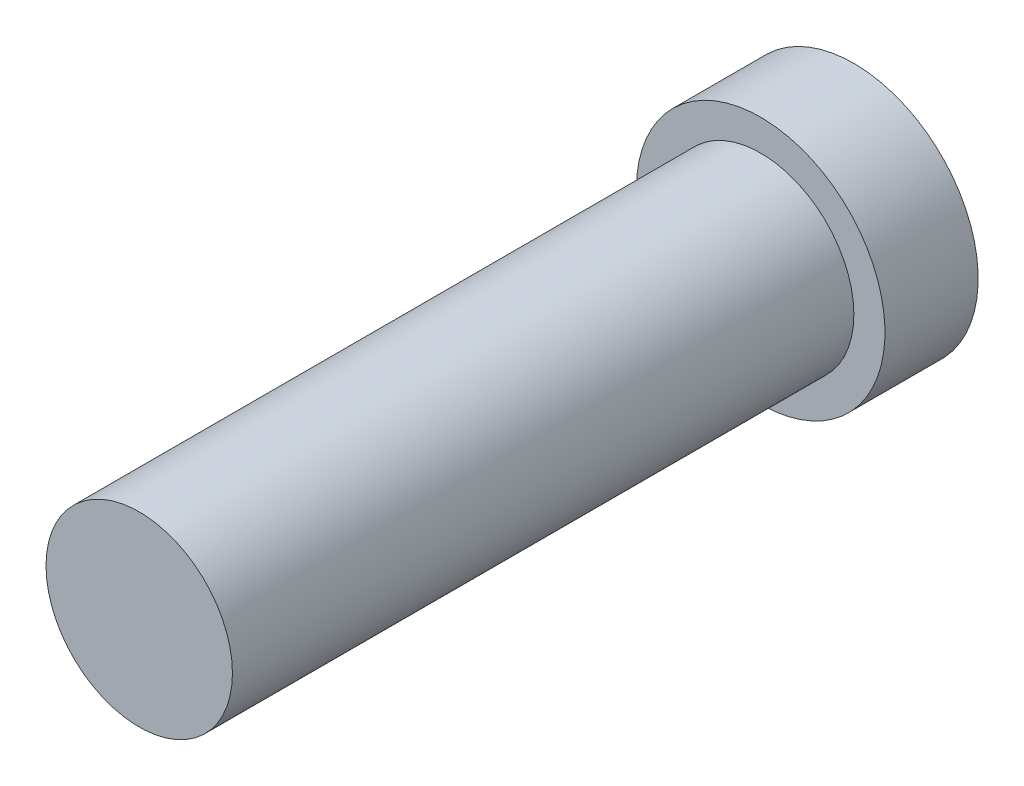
ISO-10303-21;
HEADER;
FILE_DESCRIPTION(('STEP AP214'),'2;1');
FILE_NAME('part.step','',(''),(''),'','','');
FILE_SCHEMA(('AUTOMOTIVE_DESIGN { 1 0 10303 214 1 1 1 1 }'));
ENDSEC;
DATA;
#1=APPLICATION_CONTEXT('core data for automotive mechanical design processes');
#2=APPLICATION_PROTOCOL_DEFINITION('international standard','automotive_design',2000,#1);
#3=PRODUCT_CONTEXT('',#1,'mechanical');
#4=PRODUCT('Part','Part','',(#3));
#5=PRODUCT_RELATED_PRODUCT_CATEGORY('part','',(#4));
#6=PRODUCT_DEFINITION_FORMATION('','',#4);
#7=PRODUCT_DEFINITION_CONTEXT('part definition',#1,'design');
#8=PRODUCT_DEFINITION('design','',#6,#7);
#9=PRODUCT_DEFINITION_SHAPE('','',#8);
#10=(LENGTH_UNIT() NAMED_UNIT(*) SI_UNIT(.MILLI.,.METRE.));
#11=(NAMED_UNIT(*) PLANE_ANGLE_UNIT() SI_UNIT($,.RADIAN.));
#12=(NAMED_UNIT(*) SI_UNIT($,.STERADIAN.) SOLID_ANGLE_UNIT());
#13=UNCERTAINTY_MEASURE_WITH_UNIT(LENGTH_MEASURE(1.E-05),#10,'distance_accuracy_value','');
#14=(GEOMETRIC_REPRESENTATION_CONTEXT(3) GLOBAL_UNCERTAINTY_ASSIGNED_CONTEXT((#13)) GLOBAL_UNIT_ASSIGNED_CONTEXT((#10,
#11,#12)) REPRESENTATION_CONTEXT('',''));
#15=CARTESIAN_POINT('',(0.,0.,0.));
#16=DIRECTION('',(0.,0.,1.));
#17=DIRECTION('',(1.,0.,0.));
#18=AXIS2_PLACEMENT_3D('',#15,#16,#17);
#19=CARTESIAN_POINT('',(0.,0.,10.));
#20=DIRECTION('',(0.,0.,-1.));
#21=DIRECTION('',(-1.,0.,0.));
#22=AXIS2_PLACEMENT_3D('',#19,#20,#21);
#23=CYLINDRICAL_SURFACE('',#22,1.5);
#24=CARTESIAN_POINT('',(0.,0.,10.));
#25=DIRECTION('',(0.,0.,1.));
#26=DIRECTION('',(1.,0.,0.));
#27=AXIS2_PLACEMENT_3D('',#24,#25,#26);
#28=CIRCLE('',#27,1.5);
#29=CARTESIAN_POINT('',(1.5,0.,10.));
#30=VERTEX_POINT('',#29);
#31=EDGE_CURVE('E11',#30,#30,#28,.T.);
#32=ORIENTED_EDGE('',*,*,#31,.F.);
#33=EDGE_LOOP('',(#32));
#34=FACE_BOUND('',#33,.T.);
#35=CARTESIAN_POINT('',(0.,0.,0.));
#36=DIRECTION('',(0.,0.,-1.));
#37=DIRECTION('',(-1.,0.,0.));
#38=AXIS2_PLACEMENT_3D('',#35,#36,#37);
#39=CIRCLE('',#38,1.5);
#40=CARTESIAN_POINT('',(-1.5,0.,0.));
#41=VERTEX_POINT('',#40);
#42=EDGE_CURVE('E40',#41,#41,#39,.T.);
#43=ORIENTED_EDGE('',*,*,#42,.F.);
#44=EDGE_LOOP('',(#43));
#45=FACE_BOUND('',#44,.T.);
#46=ADVANCED_FACE('F33',(#34,#45),#23,.T.);
#47=CARTESIAN_POINT('',(0.,0.,10.));
#48=DIRECTION('',(0.,0.,1.));
#49=DIRECTION('',(1.,0.,0.));
#50=AXIS2_PLACEMENT_3D('',#47,#48,#49);
#51=PLANE('',#50);
#52=ORIENTED_EDGE('',*,*,#31,.T.);
#53=EDGE_LOOP('',(#52));
#54=FACE_BOUND('',#53,.T.);
#55=ADVANCED_FACE('F216',(#54),#51,.T.);
#56=CARTESIAN_POINT('',(0.,0.,0.));
#57=DIRECTION('',(0.,0.,-1.));
#58=DIRECTION('',(-1.,0.,0.));
#59=AXIS2_PLACEMENT_3D('',#56,#57,#58);
#60=PLANE('',#59);
#61=CARTESIAN_POINT('',(0.,0.,0.));
#62=DIRECTION('',(0.,0.,-1.));
#63=DIRECTION('',(-1.,0.,0.));
#64=AXIS2_PLACEMENT_3D('',#61,#62,#63);
#65=CIRCLE('',#64,2.);
#66=CARTESIAN_POINT('',(-2.,0.,0.));
#67=VERTEX_POINT('',#66);
#68=EDGE_CURVE('E188',#67,#67,#65,.T.);
#69=ORIENTED_EDGE('',*,*,#68,.F.);
#70=EDGE_LOOP('',(#69));
#71=FACE_BOUND('',#70,.T.);
#72=ORIENTED_EDGE('',*,*,#42,.T.);
#73=EDGE_LOOP('',(#72));
#74=FACE_BOUND('',#73,.T.);
#75=ADVANCED_FACE('F213',(#71,#74),#60,.F.);
#76=CARTESIAN_POINT('',(0.,0.,-1.5));
#77=DIRECTION('',(0.,0.,1.));
#78=DIRECTION('',(1.,0.,0.));
#79=AXIS2_PLACEMENT_3D('',#76,#77,#78);
#80=CYLINDRICAL_SURFACE('',#79,2.);
#81=CARTESIAN_POINT('',(0.,0.,-1.5));
#82=DIRECTION('',(0.,0.,-1.));
#83=DIRECTION('',(-1.,0.,0.));
#84=AXIS2_PLACEMENT_3D('',#81,#82,#83);
#85=CIRCLE('',#84,2.);
#86=CARTESIAN_POINT('',(-2.,0.,-1.5));
#87=VERTEX_POINT('',#86);
#88=EDGE_CURVE('E206',#87,#87,#85,.T.);
#89=ORIENTED_EDGE('',*,*,#88,.F.);
#90=EDGE_LOOP('',(#89));
#91=FACE_BOUND('',#90,.T.);
#92=ORIENTED_EDGE('',*,*,#68,.T.);
#93=EDGE_LOOP('',(#92));
#94=FACE_BOUND('',#93,.T.);
#95=ADVANCED_FACE('F226',(#91,#94),#80,.T.);
#96=CARTESIAN_POINT('',(0.,0.,-1.5));
#97=DIRECTION('',(0.,0.,-1.));
#98=DIRECTION('',(-1.,0.,0.));
#99=AXIS2_PLACEMENT_3D('',#96,#97,#98);
#100=PLANE('',#99);
#101=DIRECTION('',(1.,0.,0.));
#102=VECTOR('',#101,1.);
#103=CARTESIAN_POINT('',(0.325,0.325,-1.5));
#104=LINE('',#103,#102);
#105=CARTESIAN_POINT('',(0.325,0.325,-1.5));
#106=VERTEX_POINT('',#105);
#107=CARTESIAN_POINT('',(1.64369086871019,0.325,-1.5));
#108=VERTEX_POINT('',#107);
#109=EDGE_CURVE('E47',#106,#108,#104,.T.);
#110=ORIENTED_EDGE('',*,*,#109,.F.);
#111=DIRECTION('',(0.,-1.,0.));
#112=VECTOR('',#111,1.);
#113=CARTESIAN_POINT('',(0.325,0.325,-1.5));
#114=LINE('',#113,#112);
#115=CARTESIAN_POINT('',(0.325,1.63111160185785,-1.5));
#116=VERTEX_POINT('',#115);
#117=EDGE_CURVE('E184',#116,#106,#114,.T.);
#118=ORIENTED_EDGE('',*,*,#117,.F.);
#119=DIRECTION('',(1.,0.,0.));
#120=VECTOR('',#119,1.);
#121=CARTESIAN_POINT('',(-0.325,1.63111160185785,-1.5));
#122=LINE('',#121,#120);
#123=CARTESIAN_POINT('',(-0.325,1.63111160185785,-1.5));
#124=VERTEX_POINT('',#123);
#125=EDGE_CURVE('E182',#124,#116,#122,.T.);
#126=ORIENTED_EDGE('',*,*,#125,.F.);
#127=DIRECTION('',(0.,1.,0.));
#128=VECTOR('',#127,1.);
#129=CARTESIAN_POINT('',(-0.325,0.325,-1.5));
#130=LINE('',#129,#128);
#131=CARTESIAN_POINT('',(-0.325,0.325,-1.5));
#132=VERTEX_POINT('',#131);
#133=EDGE_CURVE('E131',#132,#124,#130,.T.);
#134=ORIENTED_EDGE('',*,*,#133,.F.);
#135=DIRECTION('',(1.,0.,0.));
#136=VECTOR('',#135,1.);
#137=CARTESIAN_POINT('',(-1.64369086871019,0.325,-1.5));
#138=LINE('',#137,#136);
#139=CARTESIAN_POINT('',(-1.64369086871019,0.325,-1.5));
#140=VERTEX_POINT('',#139);
#141=EDGE_CURVE('E178',#140,#132,#138,.T.);
#142=ORIENTED_EDGE('',*,*,#141,.F.);
#143=DIRECTION('',(0.,1.,0.));
#144=VECTOR('',#143,1.);
#145=CARTESIAN_POINT('',(-1.64369086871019,-0.325,-1.5));
#146=LINE('',#145,#144);
#147=CARTESIAN_POINT('',(-1.64369086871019,-0.325,-1.5));
#148=VERTEX_POINT('',#147);
#149=EDGE_CURVE('E175',#148,#140,#146,.T.);
#150=ORIENTED_EDGE('',*,*,#149,.F.);
#151=DIRECTION('',(-1.,0.,0.));
#152=VECTOR('',#151,1.);
#153=CARTESIAN_POINT('',(-1.64369086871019,-0.325,-1.5));
#154=LINE('',#153,#152);
#155=CARTESIAN_POINT('',(-0.325,-0.325,-1.5));
#156=VERTEX_POINT('',#155);
#157=EDGE_CURVE('E172',#156,#148,#154,.T.);
#158=ORIENTED_EDGE('',*,*,#157,.F.);
#159=DIRECTION('',(0.,1.,0.));
#160=VECTOR('',#159,1.);
#161=CARTESIAN_POINT('',(-0.325,-1.63111160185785,-1.5));
#162=LINE('',#161,#160);
#163=CARTESIAN_POINT('',(-0.325,-1.63111160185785,-1.5));
#164=VERTEX_POINT('',#163);
#165=EDGE_CURVE('E169',#164,#156,#162,.T.);
#166=ORIENTED_EDGE('',*,*,#165,.F.);
#167=DIRECTION('',(-1.,0.,0.));
#168=VECTOR('',#167,1.);
#169=CARTESIAN_POINT('',(-0.325,-1.63111160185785,-1.5));
#170=LINE('',#169,#168);
#171=CARTESIAN_POINT('',(0.325,-1.63111160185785,-1.5));
#172=VERTEX_POINT('',#171);
#173=EDGE_CURVE('E166',#172,#164,#170,.T.);
#174=ORIENTED_EDGE('',*,*,#173,.F.);
#175=DIRECTION('',(0.,-1.,0.));
#176=VECTOR('',#175,1.);
#177=CARTESIAN_POINT('',(0.325,-1.63111160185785,-1.5));
#178=LINE('',#177,#176);
#179=CARTESIAN_POINT('',(0.325,-0.325,-1.5));
#180=VERTEX_POINT('',#179);
#181=EDGE_CURVE('E163',#180,#172,#178,.T.);
#182=ORIENTED_EDGE('',*,*,#181,.F.);
#183=DIRECTION('',(-1.,0.,0.));
#184=VECTOR('',#183,1.);
#185=CARTESIAN_POINT('',(0.325,-0.325,-1.5));
#186=LINE('',#185,#184);
#187=CARTESIAN_POINT('',(1.64369086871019,-0.325,-1.5));
#188=VERTEX_POINT('',#187);
#189=EDGE_CURVE('E160',#188,#180,#186,.T.);
#190=ORIENTED_EDGE('',*,*,#189,.F.);
#191=DIRECTION('',(0.,-1.,0.));
#192=VECTOR('',#191,1.);
#193=CARTESIAN_POINT('',(1.64369086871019,-0.325,-1.5));
#194=LINE('',#193,#192);
#195=EDGE_CURVE('E157',#108,#188,#194,.T.);
#196=ORIENTED_EDGE('',*,*,#195,.F.);
#197=EDGE_LOOP('',(#110,#118,#126,#134,#142,#150,#158,#166,#174,#182,#190,#196));
#198=FACE_BOUND('',#197,.T.);
#199=ORIENTED_EDGE('',*,*,#88,.T.);
#200=EDGE_LOOP('',(#199));
#201=FACE_BOUND('',#200,.T.);
#202=ADVANCED_FACE('F231',(#198,#201),#100,.T.);
#203=CARTESIAN_POINT('',(0.325,0.325,-1.));
#204=DIRECTION('',(0.,1.,0.));
#205=DIRECTION('',(-1.,0.,0.));
#206=AXIS2_PLACEMENT_3D('',#203,#204,#205);
#207=PLANE('',#206);
#208=ORIENTED_EDGE('',*,*,#109,.T.);
#209=DIRECTION('',(0.,0.,-1.));
#210=VECTOR('',#209,1.);
#211=CARTESIAN_POINT('',(1.64369086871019,0.325,-1.));
#212=LINE('',#211,#210);
#213=CARTESIAN_POINT('',(1.64369086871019,0.325,-1.));
#214=VERTEX_POINT('',#213);
#215=EDGE_CURVE('E95',#214,#108,#212,.T.);
#216=ORIENTED_EDGE('',*,*,#215,.F.);
#217=DIRECTION('',(1.,0.,0.));
#218=VECTOR('',#217,1.);
#219=CARTESIAN_POINT('',(0.325,0.325,-1.));
#220=LINE('',#219,#218);
#221=CARTESIAN_POINT('',(0.325,0.325,-1.));
#222=VERTEX_POINT('',#221);
#223=EDGE_CURVE('E186',#222,#214,#220,.T.);
#224=ORIENTED_EDGE('',*,*,#223,.F.);
#225=DIRECTION('',(0.,0.,-1.));
#226=VECTOR('',#225,1.);
#227=CARTESIAN_POINT('',(0.325,0.325,-1.));
#228=LINE('',#227,#226);
#229=EDGE_CURVE('E55',#222,#106,#228,.T.);
#230=ORIENTED_EDGE('',*,*,#229,.T.);
#231=EDGE_LOOP('',(#208,#216,#224,#230));
#232=FACE_BOUND('',#231,.T.);
#233=ADVANCED_FACE('F236',(#232),#207,.F.);
#234=CARTESIAN_POINT('',(0.325,0.325,-1.));
#235=DIRECTION('',(1.,0.,0.));
#236=DIRECTION('',(0.,1.,0.));
#237=AXIS2_PLACEMENT_3D('',#234,#235,#236);
#238=PLANE('',#237);
#239=ORIENTED_EDGE('',*,*,#117,.T.);
#240=ORIENTED_EDGE('',*,*,#229,.F.);
#241=DIRECTION('',(0.,-1.,0.));
#242=VECTOR('',#241,1.);
#243=CARTESIAN_POINT('',(0.325,0.325,-1.));
#244=LINE('',#243,#242);
#245=CARTESIAN_POINT('',(0.325,1.63111160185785,-1.));
#246=VERTEX_POINT('',#245);
#247=EDGE_CURVE('E143',#246,#222,#244,.T.);
#248=ORIENTED_EDGE('',*,*,#247,.F.);
#249=DIRECTION('',(0.,0.,-1.));
#250=VECTOR('',#249,1.);
#251=CARTESIAN_POINT('',(0.325,1.63111160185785,-1.));
#252=LINE('',#251,#250);
#253=EDGE_CURVE('E135',#246,#116,#252,.T.);
#254=ORIENTED_EDGE('',*,*,#253,.T.);
#255=EDGE_LOOP('',(#239,#240,#248,#254));
#256=FACE_BOUND('',#255,.T.);
#257=ADVANCED_FACE('F240',(#256),#238,.F.);
#258=CARTESIAN_POINT('',(-0.325,1.63111160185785,-1.));
#259=DIRECTION('',(0.,1.,0.));
#260=DIRECTION('',(0.,0.,1.));
#261=AXIS2_PLACEMENT_3D('',#258,#259,#260);
#262=PLANE('',#261);
#263=ORIENTED_EDGE('',*,*,#125,.T.);
#264=ORIENTED_EDGE('',*,*,#253,.F.);
#265=DIRECTION('',(1.,0.,0.));
#266=VECTOR('',#265,1.);
#267=CARTESIAN_POINT('',(-0.325,1.63111160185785,-1.));
#268=LINE('',#267,#266);
#269=CARTESIAN_POINT('',(-0.325,1.63111160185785,-1.));
#270=VERTEX_POINT('',#269);
#271=EDGE_CURVE('E139',#270,#246,#268,.T.);
#272=ORIENTED_EDGE('',*,*,#271,.F.);
#273=DIRECTION('',(0.,0.,-1.));
#274=VECTOR('',#273,1.);
#275=CARTESIAN_POINT('',(-0.325,1.63111160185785,-1.));
#276=LINE('',#275,#274);
#277=EDGE_CURVE('E124',#270,#124,#276,.T.);
#278=ORIENTED_EDGE('',*,*,#277,.T.);
#279=EDGE_LOOP('',(#263,#264,#272,#278));
#280=FACE_BOUND('',#279,.T.);
#281=ADVANCED_FACE('F140',(#280),#262,.F.);
#282=CARTESIAN_POINT('',(-0.325,0.325,-1.));
#283=DIRECTION('',(-1.,0.,0.));
#284=DIRECTION('',(0.,-1.,0.));
#285=AXIS2_PLACEMENT_3D('',#282,#283,#284);
#286=PLANE('',#285);
#287=ORIENTED_EDGE('',*,*,#133,.T.);
#288=ORIENTED_EDGE('',*,*,#277,.F.);
#289=DIRECTION('',(0.,1.,0.));
#290=VECTOR('',#289,1.);
#291=CARTESIAN_POINT('',(-0.325,0.325,-1.));
#292=LINE('',#291,#290);
#293=CARTESIAN_POINT('',(-0.325,0.325,-1.));
#294=VERTEX_POINT('',#293);
#295=EDGE_CURVE('E128',#294,#270,#292,.T.);
#296=ORIENTED_EDGE('',*,*,#295,.F.);
#297=DIRECTION('',(0.,0.,-1.));
#298=VECTOR('',#297,1.);
#299=CARTESIAN_POINT('',(-0.325,0.325,-1.));
#300=LINE('',#299,#298);
#301=EDGE_CURVE('E136',#294,#132,#300,.T.);
#302=ORIENTED_EDGE('',*,*,#301,.T.);
#303=EDGE_LOOP('',(#287,#288,#296,#302));
#304=FACE_BOUND('',#303,.T.);
#305=ADVANCED_FACE('F126',(#304),#286,.F.);
#306=CARTESIAN_POINT('',(-1.64369086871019,0.325,-1.));
#307=DIRECTION('',(0.,1.,0.));
#308=DIRECTION('',(-1.,0.,0.));
#309=AXIS2_PLACEMENT_3D('',#306,#307,#308);
#310=PLANE('',#309);
#311=ORIENTED_EDGE('',*,*,#141,.T.);
#312=ORIENTED_EDGE('',*,*,#301,.F.);
#313=DIRECTION('',(1.,0.,0.));
#314=VECTOR('',#313,1.);
#315=CARTESIAN_POINT('',(-1.64369086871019,0.325,-1.));
#316=LINE('',#315,#314);
#317=CARTESIAN_POINT('',(-1.64369086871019,0.325,-1.));
#318=VERTEX_POINT('',#317);
#319=EDGE_CURVE('E149',#318,#294,#316,.T.);
#320=ORIENTED_EDGE('',*,*,#319,.F.);
#321=DIRECTION('',(0.,0.,-1.));
#322=VECTOR('',#321,1.);
#323=CARTESIAN_POINT('',(-1.64369086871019,0.325,-1.));
#324=LINE('',#323,#322);
#325=EDGE_CURVE('E191',#318,#140,#324,.T.);
#326=ORIENTED_EDGE('',*,*,#325,.T.);
#327=EDGE_LOOP('',(#311,#312,#320,#326));
#328=FACE_BOUND('',#327,.T.);
#329=ADVANCED_FACE('F268',(#328),#310,.F.);
#330=CARTESIAN_POINT('',(-1.64369086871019,-0.325,-1.));
#331=DIRECTION('',(-1.,0.,0.));
#332=DIRECTION('',(0.,0.,1.));
#333=AXIS2_PLACEMENT_3D('',#330,#331,#332);
#334=PLANE('',#333);
#335=ORIENTED_EDGE('',*,*,#149,.T.);
#336=ORIENTED_EDGE('',*,*,#325,.F.);
#337=DIRECTION('',(0.,1.,0.));
#338=VECTOR('',#337,1.);
#339=CARTESIAN_POINT('',(-1.64369086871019,-0.325,-1.));
#340=LINE('',#339,#338);
#341=CARTESIAN_POINT('',(-1.64369086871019,-0.325,-1.));
#342=VERTEX_POINT('',#341);
#343=EDGE_CURVE('E151',#342,#318,#340,.T.);
#344=ORIENTED_EDGE('',*,*,#343,.F.);
#345=DIRECTION('',(0.,0.,-1.));
#346=VECTOR('',#345,1.);
#347=CARTESIAN_POINT('',(-1.64369086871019,-0.325,-1.));
#348=LINE('',#347,#346);
#349=EDGE_CURVE('E193',#342,#148,#348,.T.);
#350=ORIENTED_EDGE('',*,*,#349,.T.);
#351=EDGE_LOOP('',(#335,#336,#344,#350));
#352=FACE_BOUND('',#351,.T.);
#353=ADVANCED_FACE('F264',(#352),#334,.F.);
#354=CARTESIAN_POINT('',(-1.64369086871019,-0.325,-1.));
#355=DIRECTION('',(0.,-1.,0.));
#356=DIRECTION('',(0.,0.,-1.));
#357=AXIS2_PLACEMENT_3D('',#354,#355,#356);
#358=PLANE('',#357);
#359=ORIENTED_EDGE('',*,*,#157,.T.);
#360=ORIENTED_EDGE('',*,*,#349,.F.);
#361=DIRECTION('',(-1.,0.,0.));
#362=VECTOR('',#361,1.);
#363=CARTESIAN_POINT('',(-1.64369086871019,-0.325,-1.));
#364=LINE('',#363,#362);
#365=CARTESIAN_POINT('',(-0.325,-0.325,-1.));
#366=VERTEX_POINT('',#365);
#367=EDGE_CURVE('E407',#366,#342,#364,.T.);
#368=ORIENTED_EDGE('',*,*,#367,.F.);
#369=DIRECTION('',(0.,0.,-1.));
#370=VECTOR('',#369,1.);
#371=CARTESIAN_POINT('',(-0.325,-0.325,-1.));
#372=LINE('',#371,#370);
#373=EDGE_CURVE('E195',#366,#156,#372,.T.);
#374=ORIENTED_EDGE('',*,*,#373,.T.);
#375=EDGE_LOOP('',(#359,#360,#368,#374));
#376=FACE_BOUND('',#375,.T.);
#377=ADVANCED_FACE('F260',(#376),#358,.F.);
#378=CARTESIAN_POINT('',(-0.325,-1.63111160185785,-1.));
#379=DIRECTION('',(-1.,0.,0.));
#380=DIRECTION('',(0.,-1.,0.));
#381=AXIS2_PLACEMENT_3D('',#378,#379,#380);
#382=PLANE('',#381);
#383=ORIENTED_EDGE('',*,*,#165,.T.);
#384=ORIENTED_EDGE('',*,*,#373,.F.);
#385=DIRECTION('',(0.,1.,0.));
#386=VECTOR('',#385,1.);
#387=CARTESIAN_POINT('',(-0.325,-1.63111160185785,-1.));
#388=LINE('',#387,#386);
#389=CARTESIAN_POINT('',(-0.325,-1.63111160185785,-1.));
#390=VERTEX_POINT('',#389);
#391=EDGE_CURVE('E404',#390,#366,#388,.T.);
#392=ORIENTED_EDGE('',*,*,#391,.F.);
#393=DIRECTION('',(0.,0.,-1.));
#394=VECTOR('',#393,1.);
#395=CARTESIAN_POINT('',(-0.325,-1.63111160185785,-1.));
#396=LINE('',#395,#394);
#397=EDGE_CURVE('E197',#390,#164,#396,.T.);
#398=ORIENTED_EDGE('',*,*,#397,.T.);
#399=EDGE_LOOP('',(#383,#384,#392,#398));
#400=FACE_BOUND('',#399,.T.);
#401=ADVANCED_FACE('F256',(#400),#382,.F.);
#402=CARTESIAN_POINT('',(-0.325,-1.63111160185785,-1.));
#403=DIRECTION('',(0.,-1.,0.));
#404=DIRECTION('',(0.,0.,-1.));
#405=AXIS2_PLACEMENT_3D('',#402,#403,#404);
#406=PLANE('',#405);
#407=ORIENTED_EDGE('',*,*,#173,.T.);
#408=ORIENTED_EDGE('',*,*,#397,.F.);
#409=DIRECTION('',(-1.,0.,0.));
#410=VECTOR('',#409,1.);
#411=CARTESIAN_POINT('',(-0.325,-1.63111160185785,-1.));
#412=LINE('',#411,#410);
#413=CARTESIAN_POINT('',(0.325,-1.63111160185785,-1.));
#414=VERTEX_POINT('',#413);
#415=EDGE_CURVE('E401',#414,#390,#412,.T.);
#416=ORIENTED_EDGE('',*,*,#415,.F.);
#417=DIRECTION('',(0.,0.,-1.));
#418=VECTOR('',#417,1.);
#419=CARTESIAN_POINT('',(0.325,-1.63111160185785,-1.));
#420=LINE('',#419,#418);
#421=EDGE_CURVE('E199',#414,#172,#420,.T.);
#422=ORIENTED_EDGE('',*,*,#421,.T.);
#423=EDGE_LOOP('',(#407,#408,#416,#422));
#424=FACE_BOUND('',#423,.T.);
#425=ADVANCED_FACE('F252',(#424),#406,.F.);
#426=CARTESIAN_POINT('',(0.325,-1.63111160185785,-1.));
#427=DIRECTION('',(1.,0.,0.));
#428=DIRECTION('',(0.,1.,0.));
#429=AXIS2_PLACEMENT_3D('',#426,#427,#428);
#430=PLANE('',#429);
#431=ORIENTED_EDGE('',*,*,#181,.T.);
#432=ORIENTED_EDGE('',*,*,#421,.F.);
#433=DIRECTION('',(0.,-1.,0.));
#434=VECTOR('',#433,1.);
#435=CARTESIAN_POINT('',(0.325,-1.63111160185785,-1.));
#436=LINE('',#435,#434);
#437=CARTESIAN_POINT('',(0.325,-0.325,-1.));
#438=VERTEX_POINT('',#437);
#439=EDGE_CURVE('E398',#438,#414,#436,.T.);
#440=ORIENTED_EDGE('',*,*,#439,.F.);
#441=DIRECTION('',(0.,0.,-1.));
#442=VECTOR('',#441,1.);
#443=CARTESIAN_POINT('',(0.325,-0.325,-1.));
#444=LINE('',#443,#442);
#445=EDGE_CURVE('E201',#438,#180,#444,.T.);
#446=ORIENTED_EDGE('',*,*,#445,.T.);
#447=EDGE_LOOP('',(#431,#432,#440,#446));
#448=FACE_BOUND('',#447,.T.);
#449=ADVANCED_FACE('F248',(#448),#430,.F.);
#450=CARTESIAN_POINT('',(0.325,-0.325,-1.));
#451=DIRECTION('',(0.,-1.,0.));
#452=DIRECTION('',(1.,0.,0.));
#453=AXIS2_PLACEMENT_3D('',#450,#451,#452);
#454=PLANE('',#453);
#455=ORIENTED_EDGE('',*,*,#189,.T.);
#456=ORIENTED_EDGE('',*,*,#445,.F.);
#457=DIRECTION('',(-1.,0.,0.));
#458=VECTOR('',#457,1.);
#459=CARTESIAN_POINT('',(0.325,-0.325,-1.));
#460=LINE('',#459,#458);
#461=CARTESIAN_POINT('',(1.64369086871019,-0.325,-1.));
#462=VERTEX_POINT('',#461);
#463=EDGE_CURVE('E393',#462,#438,#460,.T.);
#464=ORIENTED_EDGE('',*,*,#463,.F.);
#465=DIRECTION('',(0.,0.,-1.));
#466=VECTOR('',#465,1.);
#467=CARTESIAN_POINT('',(1.64369086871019,-0.325,-1.));
#468=LINE('',#467,#466);
#469=EDGE_CURVE('E203',#462,#188,#468,.T.);
#470=ORIENTED_EDGE('',*,*,#469,.T.);
#471=EDGE_LOOP('',(#455,#456,#464,#470));
#472=FACE_BOUND('',#471,.T.);
#473=ADVANCED_FACE('F244',(#472),#454,.F.);
#474=CARTESIAN_POINT('',(1.64369086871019,-0.325,-1.));
#475=DIRECTION('',(1.,0.,0.));
#476=DIRECTION('',(0.,0.,-1.));
#477=AXIS2_PLACEMENT_3D('',#474,#475,#476);
#478=PLANE('',#477);
#479=ORIENTED_EDGE('',*,*,#195,.T.);
#480=ORIENTED_EDGE('',*,*,#469,.F.);
#481=DIRECTION('',(0.,-1.,0.));
#482=VECTOR('',#481,1.);
#483=CARTESIAN_POINT('',(1.64369086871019,-0.325,-1.));
#484=LINE('',#483,#482);
#485=EDGE_CURVE('E391',#214,#462,#484,.T.);
#486=ORIENTED_EDGE('',*,*,#485,.F.);
#487=ORIENTED_EDGE('',*,*,#215,.T.);
#488=EDGE_LOOP('',(#479,#480,#486,#487));
#489=FACE_BOUND('',#488,.T.);
#490=ADVANCED_FACE('F241',(#489),#478,.F.);
#491=CARTESIAN_POINT('',(0.,0.,-1.));
#492=DIRECTION('',(0.,0.,1.));
#493=DIRECTION('',(1.,0.,0.));
#494=AXIS2_PLACEMENT_3D('',#491,#492,#493);
#495=PLANE('',#494);
#496=ORIENTED_EDGE('',*,*,#223,.T.);
#497=ORIENTED_EDGE('',*,*,#485,.T.);
#498=ORIENTED_EDGE('',*,*,#463,.T.);
#499=ORIENTED_EDGE('',*,*,#439,.T.);
#500=ORIENTED_EDGE('',*,*,#415,.T.);
#501=ORIENTED_EDGE('',*,*,#391,.T.);
#502=ORIENTED_EDGE('',*,*,#367,.T.);
#503=ORIENTED_EDGE('',*,*,#343,.T.);
#504=ORIENTED_EDGE('',*,*,#319,.T.);
#505=ORIENTED_EDGE('',*,*,#295,.T.);
#506=ORIENTED_EDGE('',*,*,#271,.T.);
#507=ORIENTED_EDGE('',*,*,#247,.T.);
#508=EDGE_LOOP('',(#496,#497,#498,#499,#500,#501,#502,#503,#504,#505,#506,#507));
#509=FACE_BOUND('',#508,.T.);
#510=ADVANCED_FACE('F146',(#509),#495,.F.);
#511=CLOSED_SHELL('',(#46,#55,#75,#95,#202,#233,#257,#281,#305,#329,#353,#377,#401,#425,#449,
#473,#490,#510));
#512=MANIFOLD_SOLID_BREP('B2',#511);
#513=ADVANCED_BREP_SHAPE_REPRESENTATION('',(#18,#512),#14);
#514=SHAPE_DEFINITION_REPRESENTATION(#9,#513);
ENDSEC;
END-ISO-10303-21;
